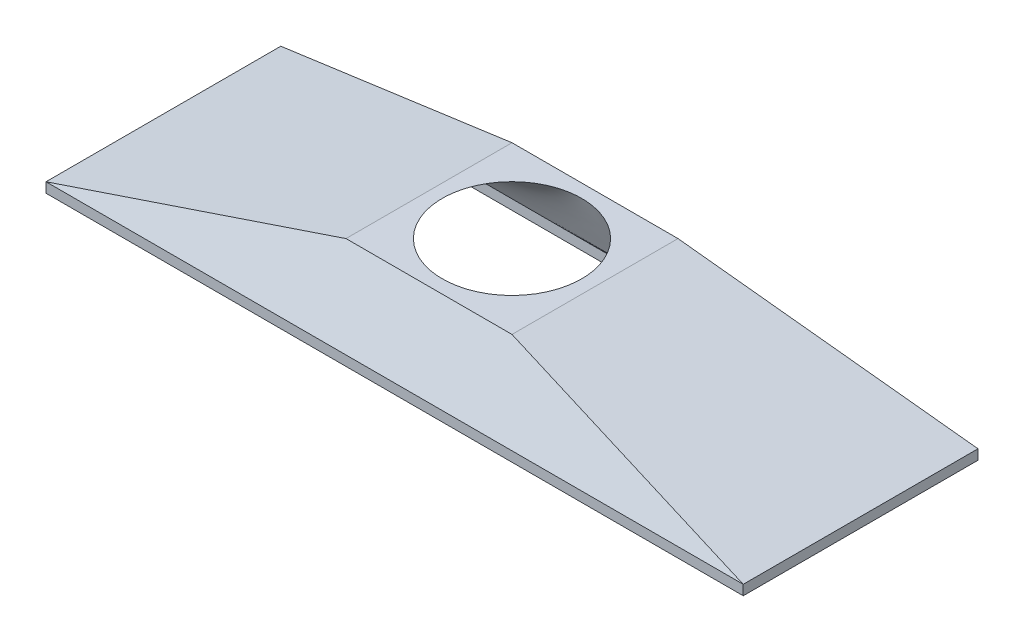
from build123d import *

# Parameters (mm, degrees)
SKETCH_6_W      = 210
SKETCH_6_H      = 70.71
SKETCH_6_W_2    = 200
SKETCH_6_H_2    = 60.71
EXTRUDE_1_DEPTH = 3


with BuildPart() as part:
    # Sketch 3 → Loft 2 section 0
    with BuildSketch(Plane(origin=(0, 20, 0), x_dir=(1, 0, 0), z_dir=(0, 1, 0))):
        with BuildLine():
            Line((-25, -25), (25, -25))
            Line((25, -25), (25, 25))
            Line((25, 25), (-25, 25))
            Line((-25, 25), (-25, -25))
        make_face()
    # Sketch 1 → Loft 2 section 1
    with BuildSketch(Plane(origin=(0, 0, 0), x_dir=(1, 0, 0), z_dir=(0, 1, 0))):
        with BuildLine():
            Line((-105, -35.355), (105, -35.355))
            Line((105, -35.355), (105, 35.355))
            Line((105, 35.355), (-105, 35.355))
            Line((-105, 35.355), (-105, -35.355))
        make_face()
    loft()

    # Sketch 4 for Loft 1 → Loft 1 section 0
    with BuildSketch(Plane(origin=(0, 20, 0), x_dir=(1, 0, 0), z_dir=(0, 1, 0))):
        with BuildLine():
            # circular arc as an exact rational Bezier (weights 1, cos(half-angle), 1)
            Bezier((20.094611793, -6.09971941), (0, -72.298407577), (-20.094611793, -6.09971941), weights=[1, 0.290462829, 1])
            Bezier((-20.094611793, -6.09971941), (-21.94618162, 0), (-20.094611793, 6.09971941), weights=[1, 0.956886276, 1])
            Bezier((-20.094611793, 6.09971941), (0, 72.298407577), (20.094611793, 6.09971941), weights=[1, 0.290462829, 1])
            Bezier((20.094611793, 6.09971941), (21.94618162, 0), (20.094611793, -6.09971941), weights=[1, 0.956886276, 1])
        make_face()
    # Sketch 5 → Loft 1 section 1
    with BuildSketch(Plane.XZ):
        with BuildLine():
            Line((100, 30.355), (-100, 30.355))
            Line((-100, 30.355), (-100, -30.355))
            Line((-100, -30.355), (100, -30.355))
            Line((100, -30.355), (100, 30.355))
        make_face()
    loft(mode=Mode.SUBTRACT)

    # Sketch 6 → Extrude 1 (add)
    with BuildSketch(Plane.XZ):
        Rectangle(SKETCH_6_W, SKETCH_6_H)
        Rectangle(SKETCH_6_W_2, SKETCH_6_H_2, mode=Mode.SUBTRACT)
    extrude(amount=EXTRUDE_1_DEPTH)


solid = part.part
